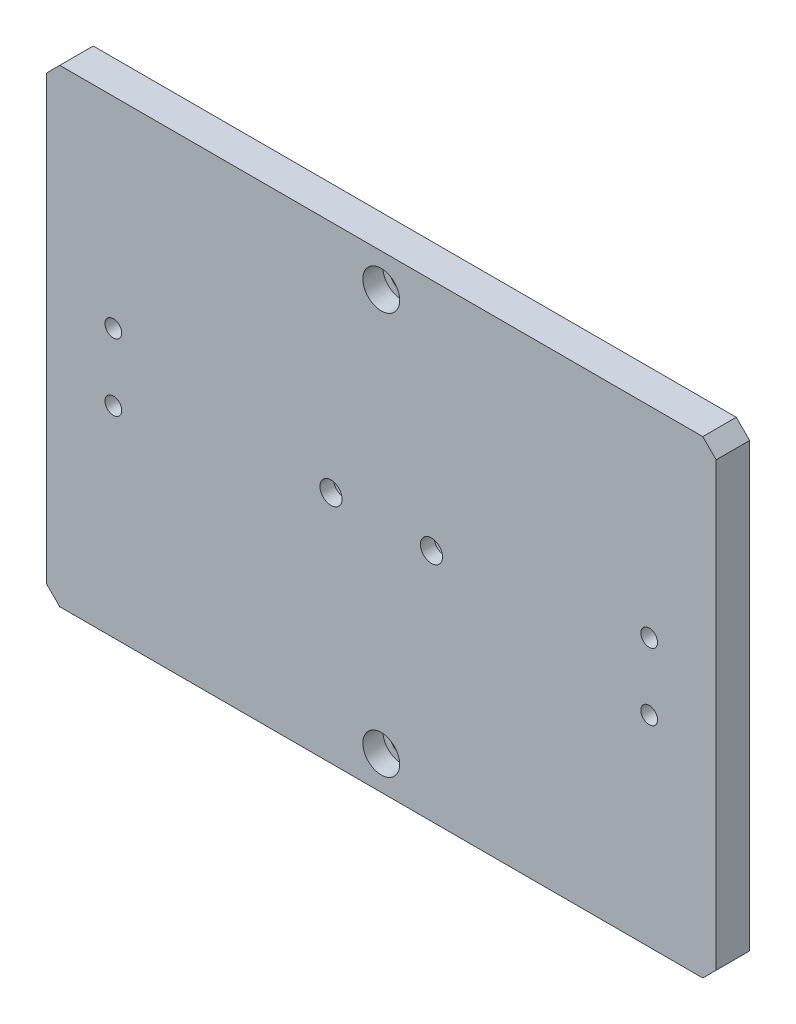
from build123d import *

# Parameters (mm, degrees)
SKETCH_1_W                   = 200
SKETCH_1_H                   = 140
EXTRUDE_1_DEPTH              = 10
CHAMFER_1_SIZE               = 4
HOLE_WIZARD_M6_1_D           = 6.6
HOLE_WIZARD_M6_1_CBORE_D     = 11
HOLE_WIZARD_M6_1_CBORE_DEPTH = 6
HOLE_WIZARD_M6_2_D           = 6.6
HOLE_WIZARD_M6_2_CBORE_D     = 11
HOLE_WIZARD_M6_2_CBORE_DEPTH = 6
HOLE_WIZARD_M6_1_2_D         = 5
HOLE_WIZARD_M6_1_2_DEPTH     = 15
HOLE_WIZARD_M6_1_2_TIP       = 1.502151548


with BuildPart() as part:
    # Sketch 1 → Extrude 1 (new body)
    with BuildSketch(Plane.XY):
        with Locations((100, 70)):
            Rectangle(SKETCH_1_W, SKETCH_1_H)
    extrude(amount=EXTRUDE_1_DEPTH)

    # Chamfer 1
    chamfer_1_edges = [part.edges().sort_by_distance(p)[0] for p in [
        (0, 140, 5),
        (200, 140, 5),
        (200, 0, 5),
        (0, 0, 5),
    ]]
    chamfer(chamfer_1_edges, length=CHAMFER_1_SIZE)

    # Hole Wizard M6 _1 (through all)
    with Locations(Plane(origin=(0, 0, 0), x_dir=(-1, 0, 0), z_dir=(0, 0, -1))):
        with Locations((-115, 70), (-85, 70)):
            CounterBoreHole(HOLE_WIZARD_M6_1_D / 2, HOLE_WIZARD_M6_1_CBORE_D / 2, HOLE_WIZARD_M6_1_CBORE_DEPTH)

    # Hole Wizard M6 _2 (through all)
    with Locations(Plane.XY.offset(10)):
        with Locations((100, 130), (100, 10)):
            CounterBoreHole(HOLE_WIZARD_M6_2_D / 2, HOLE_WIZARD_M6_2_CBORE_D / 2, HOLE_WIZARD_M6_2_CBORE_DEPTH)

    # Hole Wizard M6 _1 2
    with Locations(Plane.XY.offset(10)):
        with Locations((20, 60), (180, 60), (20, 80), (180, 80)):
            Hole(HOLE_WIZARD_M6_1_2_D / 2, depth=HOLE_WIZARD_M6_1_2_DEPTH)
            with Locations((0, 0, -(HOLE_WIZARD_M6_1_2_DEPTH + HOLE_WIZARD_M6_1_2_TIP / 2))):  # 118° drill point
                Cone(0, HOLE_WIZARD_M6_1_2_D / 2, HOLE_WIZARD_M6_1_2_TIP, mode=Mode.SUBTRACT)


solid = part.part
